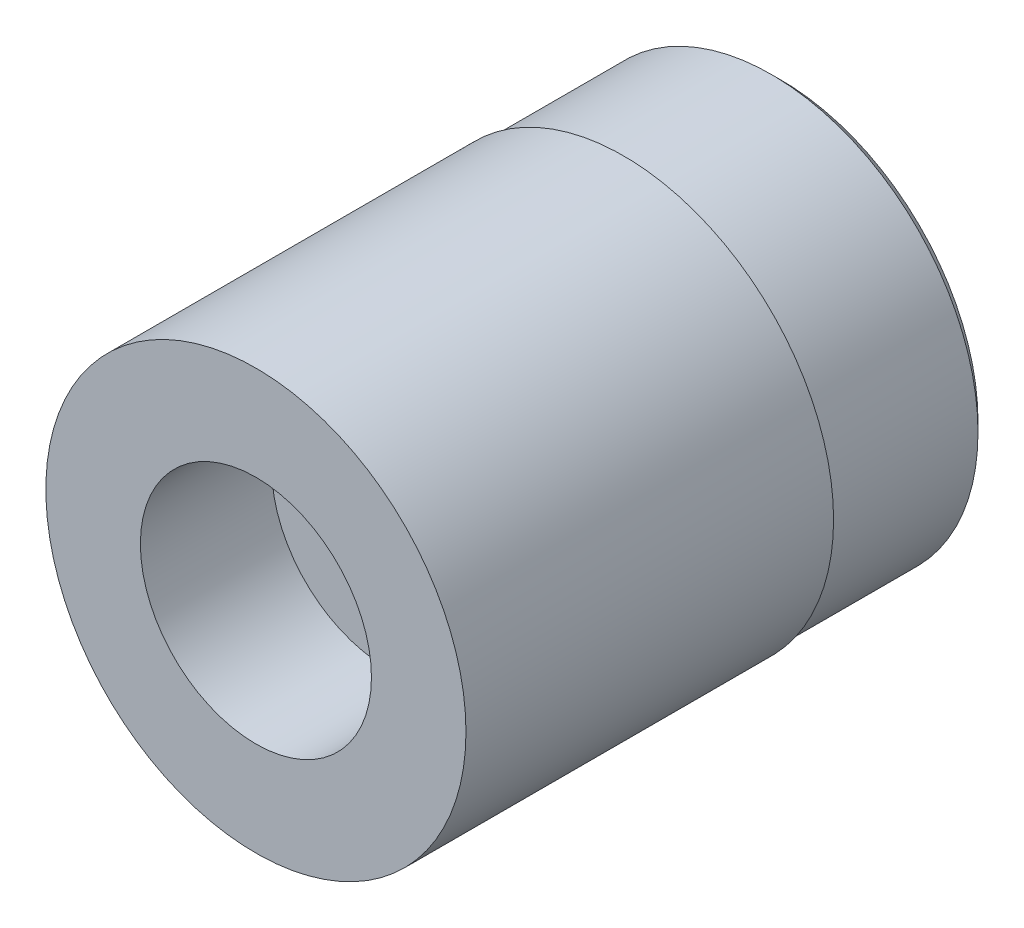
ISO-10303-21;
HEADER;
FILE_DESCRIPTION(('STEP AP214'),'2;1');
FILE_NAME('part.step','',(''),(''),'','','');
FILE_SCHEMA(('AUTOMOTIVE_DESIGN { 1 0 10303 214 1 1 1 1 }'));
ENDSEC;
DATA;
#1=APPLICATION_CONTEXT('core data for automotive mechanical design processes');
#2=APPLICATION_PROTOCOL_DEFINITION('international standard','automotive_design',2000,#1);
#3=PRODUCT_CONTEXT('',#1,'mechanical');
#4=PRODUCT('Part','Part','',(#3));
#5=PRODUCT_RELATED_PRODUCT_CATEGORY('part','',(#4));
#6=PRODUCT_DEFINITION_FORMATION('','',#4);
#7=PRODUCT_DEFINITION_CONTEXT('part definition',#1,'design');
#8=PRODUCT_DEFINITION('design','',#6,#7);
#9=PRODUCT_DEFINITION_SHAPE('','',#8);
#10=(LENGTH_UNIT() NAMED_UNIT(*) SI_UNIT(.MILLI.,.METRE.));
#11=(NAMED_UNIT(*) PLANE_ANGLE_UNIT() SI_UNIT($,.RADIAN.));
#12=(NAMED_UNIT(*) SI_UNIT($,.STERADIAN.) SOLID_ANGLE_UNIT());
#13=UNCERTAINTY_MEASURE_WITH_UNIT(LENGTH_MEASURE(1.E-05),#10,'distance_accuracy_value','');
#14=(GEOMETRIC_REPRESENTATION_CONTEXT(3) GLOBAL_UNCERTAINTY_ASSIGNED_CONTEXT((#13)) GLOBAL_UNIT_ASSIGNED_CONTEXT((#10,
#11,#12)) REPRESENTATION_CONTEXT('',''));
#15=CARTESIAN_POINT('',(0.,0.,0.));
#16=DIRECTION('',(0.,0.,1.));
#17=DIRECTION('',(1.,0.,0.));
#18=AXIS2_PLACEMENT_3D('',#15,#16,#17);
#19=CARTESIAN_POINT('',(0.,0.,3.79790950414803));
#20=DIRECTION('',(0.,0.,1.));
#21=DIRECTION('',(1.,0.,0.));
#22=AXIS2_PLACEMENT_3D('',#19,#20,#21);
#23=CYLINDRICAL_SURFACE('',#22,4.);
#24=CARTESIAN_POINT('',(0.,0.,0.));
#25=DIRECTION('',(0.,0.,1.));
#26=DIRECTION('',(1.,0.,0.));
#27=AXIS2_PLACEMENT_3D('',#24,#25,#26);
#28=CIRCLE('',#27,4.);
#29=CARTESIAN_POINT('',(4.,0.,0.));
#30=VERTEX_POINT('',#29);
#31=EDGE_CURVE('E10',#30,#30,#28,.T.);
#32=ORIENTED_EDGE('',*,*,#31,.F.);
#33=EDGE_LOOP('',(#32));
#34=FACE_BOUND('',#33,.T.);
#35=CARTESIAN_POINT('',(0.,0.,-7.));
#36=DIRECTION('',(0.,0.,-1.));
#37=DIRECTION('',(-1.,0.,0.));
#38=AXIS2_PLACEMENT_3D('',#35,#36,#37);
#39=CIRCLE('',#38,4.);
#40=CARTESIAN_POINT('',(-4.,0.,-7.));
#41=VERTEX_POINT('',#40);
#42=EDGE_CURVE('E35',#41,#41,#39,.T.);
#43=ORIENTED_EDGE('',*,*,#42,.F.);
#44=EDGE_LOOP('',(#43));
#45=FACE_BOUND('',#44,.T.);
#46=ADVANCED_FACE('F32',(#34,#45),#23,.T.);
#47=CARTESIAN_POINT('',(0.,0.,-10.));
#48=DIRECTION('',(0.,0.,1.));
#49=DIRECTION('',(1.,0.,0.));
#50=AXIS2_PLACEMENT_3D('',#47,#48,#49);
#51=CONICAL_SURFACE('',#50,3.7499999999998,0.785398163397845);
#52=CARTESIAN_POINT('',(0.,0.,-10.));
#53=DIRECTION('',(0.,0.,1.));
#54=DIRECTION('',(1.,0.,0.));
#55=AXIS2_PLACEMENT_3D('',#52,#53,#54);
#56=CIRCLE('',#55,3.7499999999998);
#57=CARTESIAN_POINT('',(3.7499999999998,0.,-10.));
#58=VERTEX_POINT('',#57);
#59=EDGE_CURVE('E53',#58,#58,#56,.T.);
#60=ORIENTED_EDGE('',*,*,#59,.T.);
#61=EDGE_LOOP('',(#60));
#62=FACE_BOUND('',#61,.T.);
#63=CARTESIAN_POINT('',(0.,0.,-9.81499999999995));
#64=DIRECTION('',(0.,0.,1.));
#65=DIRECTION('',(1.,0.,0.));
#66=AXIS2_PLACEMENT_3D('',#63,#64,#65);
#67=CIRCLE('',#66,3.935);
#68=CARTESIAN_POINT('',(3.935,0.,-9.81499999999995));
#69=VERTEX_POINT('',#68);
#70=EDGE_CURVE('E47',#69,#69,#67,.T.);
#71=ORIENTED_EDGE('',*,*,#70,.F.);
#72=EDGE_LOOP('',(#71));
#73=FACE_BOUND('',#72,.T.);
#74=ADVANCED_FACE('F79',(#62,#73),#51,.T.);
#75=CARTESIAN_POINT('',(0.,4.,0.));
#76=DIRECTION('',(0.,0.,-1.));
#77=DIRECTION('',(-1.,0.,0.));
#78=AXIS2_PLACEMENT_3D('',#75,#76,#77);
#79=PLANE('',#78);
#80=CARTESIAN_POINT('',(0.,0.,0.));
#81=DIRECTION('',(0.,0.,1.));
#82=DIRECTION('',(1.,0.,0.));
#83=AXIS2_PLACEMENT_3D('',#80,#81,#82);
#84=CIRCLE('',#83,2.2);
#85=CARTESIAN_POINT('',(2.2,0.,0.));
#86=VERTEX_POINT('',#85);
#87=EDGE_CURVE('E39',#86,#86,#84,.T.);
#88=ORIENTED_EDGE('',*,*,#87,.F.);
#89=EDGE_LOOP('',(#88));
#90=FACE_BOUND('',#89,.T.);
#91=ORIENTED_EDGE('',*,*,#31,.T.);
#92=EDGE_LOOP('',(#91));
#93=FACE_BOUND('',#92,.T.);
#94=ADVANCED_FACE('F74',(#90,#93),#79,.F.);
#95=CARTESIAN_POINT('',(0.,0.,3.79790950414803));
#96=DIRECTION('',(0.,0.,1.));
#97=DIRECTION('',(1.,0.,0.));
#98=AXIS2_PLACEMENT_3D('',#95,#96,#97);
#99=CYLINDRICAL_SURFACE('',#98,2.2);
#100=CARTESIAN_POINT('',(0.,0.,-2.5));
#101=DIRECTION('',(0.,0.,1.));
#102=DIRECTION('',(1.,0.,0.));
#103=AXIS2_PLACEMENT_3D('',#100,#101,#102);
#104=CIRCLE('',#103,2.2);
#105=CARTESIAN_POINT('',(2.2,0.,-2.5));
#106=VERTEX_POINT('',#105);
#107=EDGE_CURVE('E44',#106,#106,#104,.T.);
#108=ORIENTED_EDGE('',*,*,#107,.F.);
#109=EDGE_LOOP('',(#108));
#110=FACE_BOUND('',#109,.T.);
#111=ORIENTED_EDGE('',*,*,#87,.T.);
#112=EDGE_LOOP('',(#111));
#113=FACE_BOUND('',#112,.T.);
#114=ADVANCED_FACE('F71',(#110,#113),#99,.F.);
#115=CARTESIAN_POINT('',(0.,2.2,-2.5));
#116=DIRECTION('',(0.,0.,-1.));
#117=DIRECTION('',(-1.,0.,0.));
#118=AXIS2_PLACEMENT_3D('',#115,#116,#117);
#119=PLANE('',#118);
#120=CARTESIAN_POINT('',(0.,0.,-2.5));
#121=DIRECTION('',(0.,0.,1.));
#122=DIRECTION('',(1.,0.,0.));
#123=AXIS2_PLACEMENT_3D('',#120,#121,#122);
#124=CIRCLE('',#123,1.15);
#125=CARTESIAN_POINT('',(1.15,0.,-2.5));
#126=VERTEX_POINT('',#125);
#127=EDGE_CURVE('E64',#126,#126,#124,.T.);
#128=ORIENTED_EDGE('',*,*,#127,.F.);
#129=EDGE_LOOP('',(#128));
#130=FACE_BOUND('',#129,.T.);
#131=ORIENTED_EDGE('',*,*,#107,.T.);
#132=EDGE_LOOP('',(#131));
#133=FACE_BOUND('',#132,.T.);
#134=ADVANCED_FACE('F69',(#130,#133),#119,.F.);
#135=CARTESIAN_POINT('',(0.,0.,3.79790950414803));
#136=DIRECTION('',(0.,0.,1.));
#137=DIRECTION('',(1.,0.,0.));
#138=AXIS2_PLACEMENT_3D('',#135,#136,#137);
#139=CYLINDRICAL_SURFACE('',#138,1.15);
#140=CARTESIAN_POINT('',(0.,0.,-10.));
#141=DIRECTION('',(0.,0.,1.));
#142=DIRECTION('',(1.,0.,0.));
#143=AXIS2_PLACEMENT_3D('',#140,#141,#142);
#144=CIRCLE('',#143,1.15);
#145=CARTESIAN_POINT('',(1.15,0.,-10.));
#146=VERTEX_POINT('',#145);
#147=EDGE_CURVE('E61',#146,#146,#144,.T.);
#148=ORIENTED_EDGE('',*,*,#147,.F.);
#149=EDGE_LOOP('',(#148));
#150=FACE_BOUND('',#149,.T.);
#151=ORIENTED_EDGE('',*,*,#127,.T.);
#152=EDGE_LOOP('',(#151));
#153=FACE_BOUND('',#152,.T.);
#154=ADVANCED_FACE('F103',(#150,#153),#139,.F.);
#155=CARTESIAN_POINT('',(0.,1.15,-10.));
#156=DIRECTION('',(0.,0.,1.));
#157=DIRECTION('',(1.,0.,0.));
#158=AXIS2_PLACEMENT_3D('',#155,#156,#157);
#159=PLANE('',#158);
#160=ORIENTED_EDGE('',*,*,#59,.F.);
#161=EDGE_LOOP('',(#160));
#162=FACE_BOUND('',#161,.T.);
#163=ORIENTED_EDGE('',*,*,#147,.T.);
#164=EDGE_LOOP('',(#163));
#165=FACE_BOUND('',#164,.T.);
#166=ADVANCED_FACE('F95',(#162,#165),#159,.F.);
#167=CARTESIAN_POINT('',(0.,4.935,-7.));
#168=DIRECTION('',(0.,0.,-1.));
#169=DIRECTION('',(-1.,0.,0.));
#170=AXIS2_PLACEMENT_3D('',#167,#168,#169);
#171=PLANE('',#170);
#172=CARTESIAN_POINT('',(0.,0.,-7.));
#173=DIRECTION('',(0.,0.,1.));
#174=DIRECTION('',(1.,0.,0.));
#175=AXIS2_PLACEMENT_3D('',#172,#173,#174);
#176=CIRCLE('',#175,3.935);
#177=CARTESIAN_POINT('',(3.935,0.,-7.));
#178=VERTEX_POINT('',#177);
#179=EDGE_CURVE('E49',#178,#178,#176,.T.);
#180=ORIENTED_EDGE('',*,*,#179,.T.);
#181=EDGE_LOOP('',(#180));
#182=FACE_BOUND('',#181,.T.);
#183=ORIENTED_EDGE('',*,*,#42,.T.);
#184=EDGE_LOOP('',(#183));
#185=FACE_BOUND('',#184,.T.);
#186=ADVANCED_FACE('F92',(#182,#185),#171,.T.);
#187=CARTESIAN_POINT('',(0.,0.,0.));
#188=DIRECTION('',(0.,0.,1.));
#189=DIRECTION('',(1.,0.,0.));
#190=AXIS2_PLACEMENT_3D('',#187,#188,#189);
#191=CYLINDRICAL_SURFACE('',#190,3.935);
#192=ORIENTED_EDGE('',*,*,#179,.F.);
#193=EDGE_LOOP('',(#192));
#194=FACE_BOUND('',#193,.T.);
#195=ORIENTED_EDGE('',*,*,#70,.T.);
#196=EDGE_LOOP('',(#195));
#197=FACE_BOUND('',#196,.T.);
#198=ADVANCED_FACE('F94',(#194,#197),#191,.T.);
#199=CLOSED_SHELL('',(#46,#74,#94,#114,#134,#154,#166,#186,#198));
#200=MANIFOLD_SOLID_BREP('B2',#199);
#201=ADVANCED_BREP_SHAPE_REPRESENTATION('',(#18,#200),#14);
#202=SHAPE_DEFINITION_REPRESENTATION(#9,#201);
ENDSEC;
END-ISO-10303-21;
